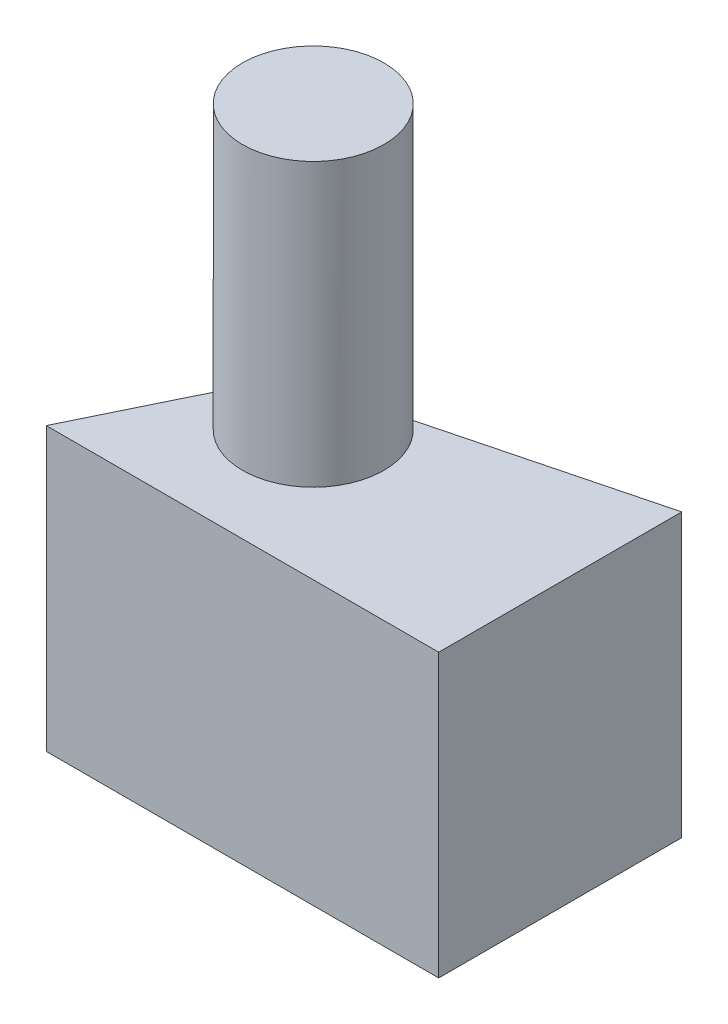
ISO-10303-21;
HEADER;
FILE_DESCRIPTION(('STEP AP214'),'2;1');
FILE_NAME('part.step','',(''),(''),'','','');
FILE_SCHEMA(('AUTOMOTIVE_DESIGN { 1 0 10303 214 1 1 1 1 }'));
ENDSEC;
DATA;
#1=APPLICATION_CONTEXT('core data for automotive mechanical design processes');
#2=APPLICATION_PROTOCOL_DEFINITION('international standard','automotive_design',2000,#1);
#3=PRODUCT_CONTEXT('',#1,'mechanical');
#4=PRODUCT('Part','Part','',(#3));
#5=PRODUCT_RELATED_PRODUCT_CATEGORY('part','',(#4));
#6=PRODUCT_DEFINITION_FORMATION('','',#4);
#7=PRODUCT_DEFINITION_CONTEXT('part definition',#1,'design');
#8=PRODUCT_DEFINITION('design','',#6,#7);
#9=PRODUCT_DEFINITION_SHAPE('','',#8);
#10=(LENGTH_UNIT() NAMED_UNIT(*) SI_UNIT(.MILLI.,.METRE.));
#11=(NAMED_UNIT(*) PLANE_ANGLE_UNIT() SI_UNIT($,.RADIAN.));
#12=(NAMED_UNIT(*) SI_UNIT($,.STERADIAN.) SOLID_ANGLE_UNIT());
#13=UNCERTAINTY_MEASURE_WITH_UNIT(LENGTH_MEASURE(1.E-05),#10,'distance_accuracy_value','');
#14=(GEOMETRIC_REPRESENTATION_CONTEXT(3) GLOBAL_UNCERTAINTY_ASSIGNED_CONTEXT((#13)) GLOBAL_UNIT_ASSIGNED_CONTEXT((#10,
#11,#12)) REPRESENTATION_CONTEXT('',''));
#15=CARTESIAN_POINT('',(0.,0.,0.));
#16=DIRECTION('',(0.,0.,1.));
#17=DIRECTION('',(1.,0.,0.));
#18=AXIS2_PLACEMENT_3D('',#15,#16,#17);
#19=CARTESIAN_POINT('',(0.,10.,0.));
#20=DIRECTION('',(0.,0.,-1.));
#21=DIRECTION('',(-1.,0.,0.));
#22=AXIS2_PLACEMENT_3D('',#19,#20,#21);
#23=PLANE('',#22);
#24=DIRECTION('',(1.,0.,0.));
#25=VECTOR('',#24,1.);
#26=CARTESIAN_POINT('',(0.,0.,0.));
#27=LINE('',#26,#25);
#28=CARTESIAN_POINT('',(0.,0.,0.));
#29=VERTEX_POINT('',#28);
#30=CARTESIAN_POINT('',(13.9101166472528,0.,0.));
#31=VERTEX_POINT('',#30);
#32=EDGE_CURVE('E106',#29,#31,#27,.T.);
#33=ORIENTED_EDGE('',*,*,#32,.T.);
#34=DIRECTION('',(0.,-1.,0.));
#35=VECTOR('',#34,1.);
#36=CARTESIAN_POINT('',(13.9101166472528,10.,0.));
#37=LINE('',#36,#35);
#38=CARTESIAN_POINT('',(13.9101166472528,10.,0.));
#39=VERTEX_POINT('',#38);
#40=EDGE_CURVE('E36',#39,#31,#37,.T.);
#41=ORIENTED_EDGE('',*,*,#40,.F.);
#42=DIRECTION('',(1.,0.,0.));
#43=VECTOR('',#42,1.);
#44=CARTESIAN_POINT('',(0.,10.,0.));
#45=LINE('',#44,#43);
#46=CARTESIAN_POINT('',(0.,10.,0.));
#47=VERTEX_POINT('',#46);
#48=EDGE_CURVE('E109',#47,#39,#45,.T.);
#49=ORIENTED_EDGE('',*,*,#48,.F.);
#50=DIRECTION('',(0.,-1.,0.));
#51=VECTOR('',#50,1.);
#52=CARTESIAN_POINT('',(0.,10.,0.));
#53=LINE('',#52,#51);
#54=EDGE_CURVE('E113',#47,#29,#53,.T.);
#55=ORIENTED_EDGE('',*,*,#54,.T.);
#56=EDGE_LOOP('',(#33,#41,#49,#55));
#57=FACE_BOUND('',#56,.T.);
#58=ADVANCED_FACE('F33',(#57),#23,.F.);
#59=CARTESIAN_POINT('',(13.9101166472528,10.,0.));
#60=DIRECTION('',(-1.,0.,0.));
#61=DIRECTION('',(0.,0.,1.));
#62=AXIS2_PLACEMENT_3D('',#59,#60,#61);
#63=PLANE('',#62);
#64=DIRECTION('',(0.,0.,-1.));
#65=VECTOR('',#64,1.);
#66=CARTESIAN_POINT('',(13.9101166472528,0.,0.));
#67=LINE('',#66,#65);
#68=CARTESIAN_POINT('',(13.9101166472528,0.,-8.61354961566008));
#69=VERTEX_POINT('',#68);
#70=EDGE_CURVE('E116',#31,#69,#67,.T.);
#71=ORIENTED_EDGE('',*,*,#70,.T.);
#72=DIRECTION('',(0.,-1.,0.));
#73=VECTOR('',#72,1.);
#74=CARTESIAN_POINT('',(13.9101166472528,10.,-8.61354961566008));
#75=LINE('',#74,#73);
#76=CARTESIAN_POINT('',(13.9101166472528,10.,-8.61354961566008));
#77=VERTEX_POINT('',#76);
#78=EDGE_CURVE('E122',#77,#69,#75,.T.);
#79=ORIENTED_EDGE('',*,*,#78,.F.);
#80=DIRECTION('',(0.,0.,-1.));
#81=VECTOR('',#80,1.);
#82=CARTESIAN_POINT('',(13.9101166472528,10.,0.));
#83=LINE('',#82,#81);
#84=EDGE_CURVE('E82',#39,#77,#83,.T.);
#85=ORIENTED_EDGE('',*,*,#84,.F.);
#86=ORIENTED_EDGE('',*,*,#40,.T.);
#87=EDGE_LOOP('',(#71,#79,#85,#86));
#88=FACE_BOUND('',#87,.T.);
#89=ADVANCED_FACE('F125',(#88),#63,.F.);
#90=CARTESIAN_POINT('',(2.79123414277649,10.,-5.7446476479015));
#91=DIRECTION('',(0.249838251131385,0.,0.968287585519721));
#92=DIRECTION('',(0.968287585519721,0.,-0.249838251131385));
#93=AXIS2_PLACEMENT_3D('',#90,#91,#92);
#94=PLANE('',#93);
#95=DIRECTION('',(-0.968287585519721,0.,0.249838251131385));
#96=VECTOR('',#95,1.);
#97=CARTESIAN_POINT('',(2.79123414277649,0.,-5.7446476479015));
#98=LINE('',#97,#96);
#99=CARTESIAN_POINT('',(2.79123414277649,0.,-5.7446476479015));
#100=VERTEX_POINT('',#99);
#101=EDGE_CURVE('E118',#69,#100,#98,.T.);
#102=ORIENTED_EDGE('',*,*,#101,.T.);
#103=DIRECTION('',(0.,-1.,0.));
#104=VECTOR('',#103,1.);
#105=CARTESIAN_POINT('',(2.79123414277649,10.,-5.7446476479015));
#106=LINE('',#105,#104);
#107=CARTESIAN_POINT('',(2.79123414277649,10.,-5.7446476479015));
#108=VERTEX_POINT('',#107);
#109=EDGE_CURVE('E94',#108,#100,#106,.T.);
#110=ORIENTED_EDGE('',*,*,#109,.F.);
#111=DIRECTION('',(-0.968287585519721,0.,0.249838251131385));
#112=VECTOR('',#111,1.);
#113=CARTESIAN_POINT('',(2.79123414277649,10.,-5.7446476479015));
#114=LINE('',#113,#112);
#115=CARTESIAN_POINT('',(6.30902414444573,10.,-6.65231032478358));
#116=VERTEX_POINT('',#115);
#117=EDGE_CURVE('E90',#116,#108,#114,.T.);
#118=ORIENTED_EDGE('',*,*,#117,.F.);
#119=EDGE_CURVE('E85',#77,#116,#114,.T.);
#120=ORIENTED_EDGE('',*,*,#119,.F.);
#121=ORIENTED_EDGE('',*,*,#78,.T.);
#122=EDGE_LOOP('',(#102,#110,#118,#120,#121));
#123=FACE_BOUND('',#122,.T.);
#124=ADVANCED_FACE('F93',(#123),#94,.F.);
#125=CARTESIAN_POINT('',(0.,10.,0.));
#126=DIRECTION('',(0.899448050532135,0.,0.43702769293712));
#127=DIRECTION('',(0.43702769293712,0.,-0.899448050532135));
#128=AXIS2_PLACEMENT_3D('',#125,#126,#127);
#129=PLANE('',#128);
#130=DIRECTION('',(-0.43702769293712,0.,0.899448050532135));
#131=VECTOR('',#130,1.);
#132=CARTESIAN_POINT('',(0.,0.,0.));
#133=LINE('',#132,#131);
#134=EDGE_CURVE('E74',#100,#29,#133,.T.);
#135=ORIENTED_EDGE('',*,*,#134,.T.);
#136=ORIENTED_EDGE('',*,*,#54,.F.);
#137=DIRECTION('',(-0.43702769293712,0.,0.899448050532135));
#138=VECTOR('',#137,1.);
#139=CARTESIAN_POINT('',(0.,10.,0.));
#140=LINE('',#139,#138);
#141=CARTESIAN_POINT('',(2.35320273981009,10.,-4.8431338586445));
#142=VERTEX_POINT('',#141);
#143=EDGE_CURVE('E52',#142,#47,#140,.T.);
#144=ORIENTED_EDGE('',*,*,#143,.F.);
#145=EDGE_CURVE('E103',#108,#142,#140,.T.);
#146=ORIENTED_EDGE('',*,*,#145,.F.);
#147=ORIENTED_EDGE('',*,*,#109,.T.);
#148=EDGE_LOOP('',(#135,#136,#144,#146,#147));
#149=FACE_BOUND('',#148,.T.);
#150=ADVANCED_FACE('F131',(#149),#129,.F.);
#151=CARTESIAN_POINT('',(0.,10.,0.));
#152=DIRECTION('',(0.,1.,0.));
#153=DIRECTION('',(0.,0.,1.));
#154=AXIS2_PLACEMENT_3D('',#151,#152,#153);
#155=PLANE('',#154);
#156=CARTESIAN_POINT('',(4.85045458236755,10.,-4.61216630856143));
#157=DIRECTION('',(0.,1.,0.));
#158=DIRECTION('',(0.,0.,1.));
#159=AXIS2_PLACEMENT_3D('',#156,#157,#158);
#160=CIRCLE('',#159,2.5079100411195);
#161=EDGE_CURVE('E11',#142,#116,#160,.T.);
#162=ORIENTED_EDGE('',*,*,#161,.F.);
#163=ORIENTED_EDGE('',*,*,#143,.T.);
#164=ORIENTED_EDGE('',*,*,#48,.T.);
#165=ORIENTED_EDGE('',*,*,#84,.T.);
#166=ORIENTED_EDGE('',*,*,#119,.T.);
#167=EDGE_LOOP('',(#162,#163,#164,#165,#166));
#168=FACE_BOUND('',#167,.T.);
#169=ADVANCED_FACE('F87',(#168),#155,.T.);
#170=CARTESIAN_POINT('',(0.,0.,0.));
#171=DIRECTION('',(0.,1.,0.));
#172=DIRECTION('',(0.,0.,1.));
#173=AXIS2_PLACEMENT_3D('',#170,#171,#172);
#174=PLANE('',#173);
#175=ORIENTED_EDGE('',*,*,#32,.F.);
#176=ORIENTED_EDGE('',*,*,#134,.F.);
#177=ORIENTED_EDGE('',*,*,#101,.F.);
#178=ORIENTED_EDGE('',*,*,#70,.F.);
#179=EDGE_LOOP('',(#175,#176,#177,#178));
#180=FACE_BOUND('',#179,.T.);
#181=ADVANCED_FACE('F130',(#180),#174,.F.);
#182=CARTESIAN_POINT('',(4.85045458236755,10.,-4.61216630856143));
#183=DIRECTION('',(0.,1.,0.));
#184=DIRECTION('',(0.,0.,1.));
#185=AXIS2_PLACEMENT_3D('',#182,#183,#184);
#186=PLANE('',#185);
#187=EDGE_CURVE('E42',#116,#142,#160,.T.);
#188=ORIENTED_EDGE('',*,*,#187,.F.);
#189=ORIENTED_EDGE('',*,*,#117,.T.);
#190=ORIENTED_EDGE('',*,*,#145,.T.);
#191=EDGE_LOOP('',(#188,#189,#190));
#192=FACE_BOUND('',#191,.T.);
#193=ADVANCED_FACE('F102',(#192),#186,.F.);
#194=CARTESIAN_POINT('',(4.85045458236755,20.,-4.61216630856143));
#195=DIRECTION('',(0.,-1.,0.));
#196=DIRECTION('',(0.,0.,-1.));
#197=AXIS2_PLACEMENT_3D('',#194,#195,#196);
#198=CYLINDRICAL_SURFACE('',#197,2.5079100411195);
#199=CARTESIAN_POINT('',(4.85045458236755,20.,-4.61216630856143));
#200=DIRECTION('',(0.,1.,0.));
#201=DIRECTION('',(0.,0.,1.));
#202=AXIS2_PLACEMENT_3D('',#199,#200,#201);
#203=CIRCLE('',#202,2.5079100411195);
#204=CARTESIAN_POINT('',(4.85045458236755,20.,-2.10425626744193));
#205=VERTEX_POINT('',#204);
#206=EDGE_CURVE('E104',#205,#205,#203,.T.);
#207=ORIENTED_EDGE('',*,*,#206,.F.);
#208=EDGE_LOOP('',(#207));
#209=FACE_BOUND('',#208,.T.);
#210=ORIENTED_EDGE('',*,*,#187,.T.);
#211=ORIENTED_EDGE('',*,*,#161,.T.);
#212=EDGE_LOOP('',(#210,#211));
#213=FACE_BOUND('',#212,.T.);
#214=ADVANCED_FACE('F101',(#209,#213),#198,.T.);
#215=CARTESIAN_POINT('',(4.85045458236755,20.,-4.61216630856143));
#216=DIRECTION('',(0.,1.,0.));
#217=DIRECTION('',(0.,0.,1.));
#218=AXIS2_PLACEMENT_3D('',#215,#216,#217);
#219=PLANE('',#218);
#220=ORIENTED_EDGE('',*,*,#206,.T.);
#221=EDGE_LOOP('',(#220));
#222=FACE_BOUND('',#221,.T.);
#223=ADVANCED_FACE('F182',(#222),#219,.T.);
#224=CLOSED_SHELL('',(#58,#89,#124,#150,#169,#181,#193,#214,#223));
#225=MANIFOLD_SOLID_BREP('B2',#224);
#226=ADVANCED_BREP_SHAPE_REPRESENTATION('',(#18,#225),#14);
#227=SHAPE_DEFINITION_REPRESENTATION(#9,#226);
ENDSEC;
END-ISO-10303-21;
